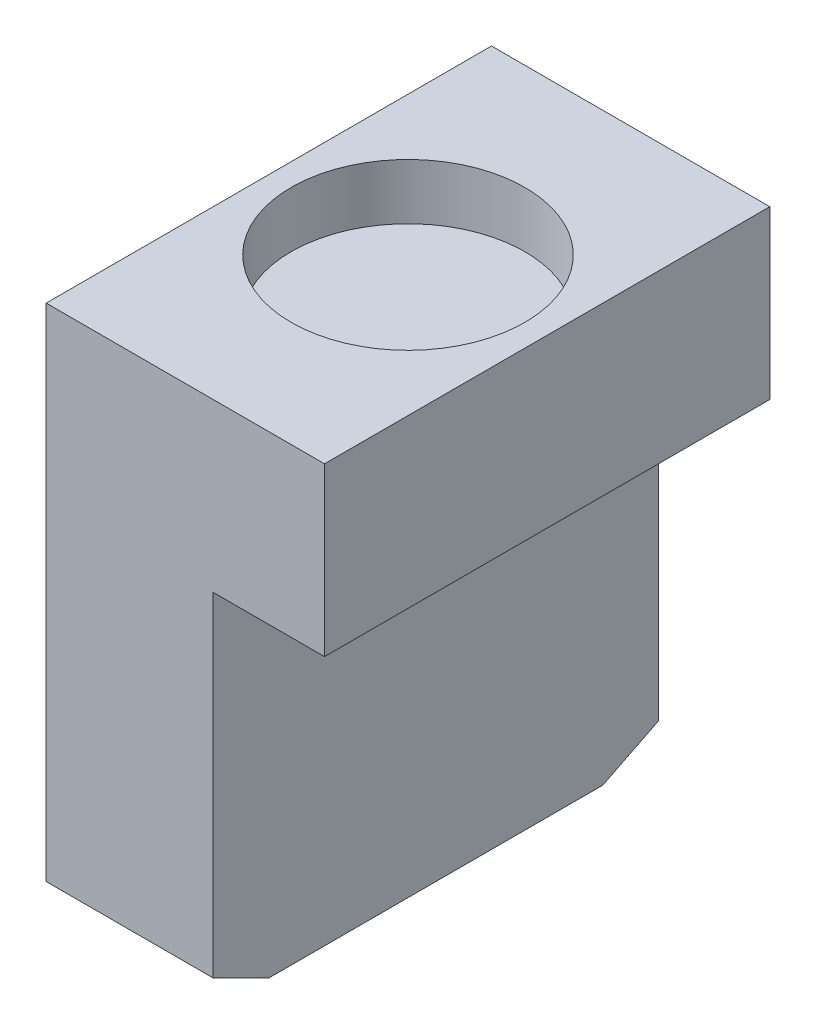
from build123d import *

# Parameters (mm, degrees)
EXTRUDE_1_DEPTH     = 8
SKETCH_2_R          = 2.1
CUT_EXTRUDE_1_DEPTH = 1
SKETCH_4_OUTSIDE_W  = 12.678
SKETCH_4_OUTSIDE_H  = 14.178
CUT_EXTRUDE_2_DEPTH = 3


with BuildPart() as part:
    # Sketch 1 → Extrude 1 (new body)
    with BuildSketch(Plane.XY):
        Polygon((0, 0), (0, 9.5), (5, 9.5), (5, 6.5), (3, 6.5), (3, 0), align=None)
    extrude(amount=EXTRUDE_1_DEPTH)

    # Sketch 2 → Cut-Extrude 1 (cut)
    with BuildSketch(Plane(origin=(0, 9.5, 0), x_dir=(1, 0, 0), z_dir=(0, 1, 0))):
        with Locations(Location((2.5, -4, 0), (0, 0, 270))):
            Circle(SKETCH_2_R)
    extrude(amount=-CUT_EXTRUDE_1_DEPTH, mode=Mode.SUBTRACT)

    # Sketch 4 outside → Cut-Extrude 2 (cut)
    with BuildSketch(Plane(origin=(3, 0, 0), x_dir=(0, 0, -1), z_dir=(1, 0, 0))):
        with Locations((-4, 4.75)):
            Rectangle(SKETCH_4_OUTSIDE_W, SKETCH_4_OUTSIDE_H)
        Polygon((-8, 0.5), (-8, 9.5), (0, 9.5), (0, 0.5), (-1, 0), (-7, 0), align=None, mode=Mode.SUBTRACT)
    extrude(amount=-CUT_EXTRUDE_2_DEPTH, mode=Mode.SUBTRACT)


solid = part.part
